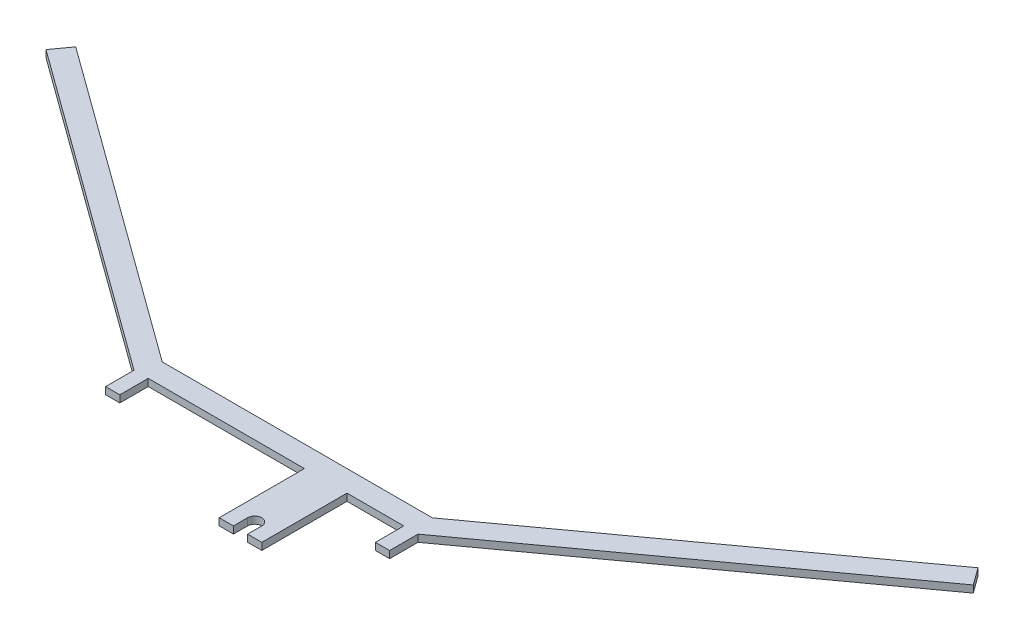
from build123d import *

# Parameters (mm, degrees)
EXTRUDE_1_DEPTH     = 0.25
SKETCH_2_W          = 1
SKETCH_2_H          = 2
EXTRUDE_2_DEPTH     = 0.5
SKETCH_5_W          = 4.537094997
SKETCH_5_H          = 4.32216947
CUT_EXTRUDE_1_DEPTH = 59.470879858
SKETCH_6_W          = 3
SKETCH_6_H          = 6
EXTRUDE_3_DEPTH     = 0.5
CUT_EXTRUDE_2_DEPTH = 62.829150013
SKETCH_8_W          = 1
SKETCH_8_H          = 2
EXTRUDE_4_DEPTH     = 0.5


with BuildPart() as part:
    # Sketch 1 → Extrude 1 (new, symmetric)
    with BuildSketch(Plane(origin=(0, 0, 0), x_dir=(1, 0, 0), z_dir=(0, 1, 0))):
        Polygon((-31.773422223, -28.831720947), (-9.512743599, -45), (9.512743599, -45), (31.773422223, -28.831720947), (32.654919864, -30.045377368), (10, -46.5), (-10, -46.5), (-32.654919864, -30.045377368), align=None)
    extrude(amount=EXTRUDE_1_DEPTH, both=True)

    # Sketch 2 → Extrude 2 (add)
    with BuildSketch(Plane(origin=(0, 0.25, 0), x_dir=(1, 0, 0), z_dir=(0, 1, 0))):
        with Locations((-9.5, -47.5)):
            Rectangle(SKETCH_2_W, SKETCH_2_H)
        with Locations((9.5, -47.5)):
            Rectangle(SKETCH_2_W, SKETCH_2_H)
    extrude(amount=-EXTRUDE_2_DEPTH)

    # Sketch 5 → Cut-Extrude 1 (cut, through all)
    with BuildSketch(Plane.XZ.offset(0.25)):
        with Locations((11.268547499, 48.661084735)):
            Rectangle(SKETCH_5_W, SKETCH_5_H)
    extrude(amount=-CUT_EXTRUDE_1_DEPTH, mode=Mode.SUBTRACT)

    # Sketch 6 → Extrude 3 (add)
    with BuildSketch(Plane.XZ.offset(0.25)):
        with Locations((3.5, 49.5)):
            Rectangle(SKETCH_6_W, SKETCH_6_H)
    extrude(amount=-EXTRUDE_3_DEPTH)

    # Sketch 7 → Cut-Extrude 2 (cut, through all)
    with BuildSketch(Plane.XZ.offset(0.25)):
        with BuildLine():
            Line((3, 51.5), (3, 55.278413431))
            Line((3, 55.278413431), (4, 55.278413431))
            Line((4, 55.278413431), (4, 51.5))
            ThreePointArc((4, 51.5), (3.5, 51), (3, 51.5))
        make_face()
    extrude(amount=-CUT_EXTRUDE_2_DEPTH, mode=Mode.SUBTRACT)

    # Sketch 8 → Extrude 4 (add)
    with BuildSketch(Plane.XZ.offset(0.25)):
        with Locations((9.5, 47.5)):
            Rectangle(SKETCH_8_W, SKETCH_8_H)
    extrude(amount=-EXTRUDE_4_DEPTH)


solid = part.part
